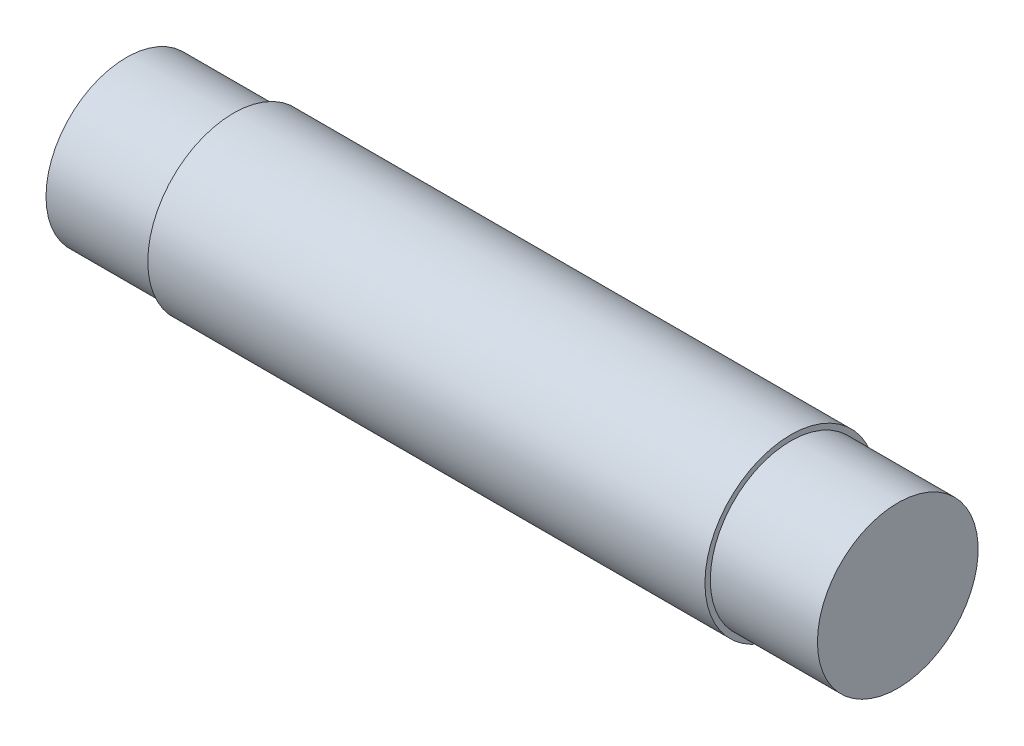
ISO-10303-21;
HEADER;
FILE_DESCRIPTION(('STEP AP214'),'2;1');
FILE_NAME('part.step','',(''),(''),'','','');
FILE_SCHEMA(('AUTOMOTIVE_DESIGN { 1 0 10303 214 1 1 1 1 }'));
ENDSEC;
DATA;
#1=APPLICATION_CONTEXT('core data for automotive mechanical design processes');
#2=APPLICATION_PROTOCOL_DEFINITION('international standard','automotive_design',2000,#1);
#3=PRODUCT_CONTEXT('',#1,'mechanical');
#4=PRODUCT('Part','Part','',(#3));
#5=PRODUCT_RELATED_PRODUCT_CATEGORY('part','',(#4));
#6=PRODUCT_DEFINITION_FORMATION('','',#4);
#7=PRODUCT_DEFINITION_CONTEXT('part definition',#1,'design');
#8=PRODUCT_DEFINITION('design','',#6,#7);
#9=PRODUCT_DEFINITION_SHAPE('','',#8);
#10=(LENGTH_UNIT() NAMED_UNIT(*) SI_UNIT(.MILLI.,.METRE.));
#11=(NAMED_UNIT(*) PLANE_ANGLE_UNIT() SI_UNIT($,.RADIAN.));
#12=(NAMED_UNIT(*) SI_UNIT($,.STERADIAN.) SOLID_ANGLE_UNIT());
#13=UNCERTAINTY_MEASURE_WITH_UNIT(LENGTH_MEASURE(1.E-05),#10,'distance_accuracy_value','');
#14=(GEOMETRIC_REPRESENTATION_CONTEXT(3) GLOBAL_UNCERTAINTY_ASSIGNED_CONTEXT((#13)) GLOBAL_UNIT_ASSIGNED_CONTEXT((#10,
#11,#12)) REPRESENTATION_CONTEXT('',''));
#15=CARTESIAN_POINT('',(0.,0.,0.));
#16=DIRECTION('',(0.,0.,1.));
#17=DIRECTION('',(1.,0.,0.));
#18=AXIS2_PLACEMENT_3D('',#15,#16,#17);
#19=CARTESIAN_POINT('',(72.,0.,0.));
#20=DIRECTION('',(1.,0.,0.));
#21=DIRECTION('',(0.,0.,-1.));
#22=AXIS2_PLACEMENT_3D('',#19,#20,#21);
#23=PLANE('',#22);
#24=CARTESIAN_POINT('',(72.,0.,0.));
#25=DIRECTION('',(-1.,0.,0.));
#26=DIRECTION('',(0.,0.,1.));
#27=AXIS2_PLACEMENT_3D('',#24,#25,#26);
#28=CIRCLE('',#27,7.5);
#29=CARTESIAN_POINT('',(72.,0.,7.5));
#30=VERTEX_POINT('',#29);
#31=EDGE_CURVE('E18',#30,#30,#28,.T.);
#32=ORIENTED_EDGE('',*,*,#31,.F.);
#33=EDGE_LOOP('',(#32));
#34=FACE_BOUND('',#33,.T.);
#35=ADVANCED_FACE('F15',(#34),#23,.T.);
#36=CARTESIAN_POINT('',(0.,0.,0.));
#37=DIRECTION('',(1.,0.,0.));
#38=DIRECTION('',(0.,0.,-1.));
#39=AXIS2_PLACEMENT_3D('',#36,#37,#38);
#40=PLANE('',#39);
#41=CARTESIAN_POINT('',(0.,0.,0.));
#42=DIRECTION('',(-1.,0.,0.));
#43=DIRECTION('',(0.,0.,1.));
#44=AXIS2_PLACEMENT_3D('',#41,#42,#43);
#45=CIRCLE('',#44,7.5);
#46=CARTESIAN_POINT('',(0.,0.,7.5));
#47=VERTEX_POINT('',#46);
#48=EDGE_CURVE('E34',#47,#47,#45,.F.);
#49=ORIENTED_EDGE('',*,*,#48,.F.);
#50=EDGE_LOOP('',(#49));
#51=FACE_BOUND('',#50,.T.);
#52=ADVANCED_FACE('F44',(#51),#40,.F.);
#53=CARTESIAN_POINT('',(72.,0.,0.));
#54=DIRECTION('',(-1.,0.,0.));
#55=DIRECTION('',(0.,0.,1.));
#56=AXIS2_PLACEMENT_3D('',#53,#54,#55);
#57=CYLINDRICAL_SURFACE('',#56,7.5);
#58=CARTESIAN_POINT('',(62.,0.,0.));
#59=DIRECTION('',(-1.,0.,0.));
#60=DIRECTION('',(0.,0.,1.));
#61=AXIS2_PLACEMENT_3D('',#58,#59,#60);
#62=CIRCLE('',#61,7.5);
#63=CARTESIAN_POINT('',(62.,0.,7.5));
#64=VERTEX_POINT('',#63);
#65=EDGE_CURVE('E32',#64,#64,#62,.T.);
#66=ORIENTED_EDGE('',*,*,#65,.F.);
#67=EDGE_LOOP('',(#66));
#68=FACE_BOUND('',#67,.T.);
#69=ORIENTED_EDGE('',*,*,#31,.T.);
#70=EDGE_LOOP('',(#69));
#71=FACE_BOUND('',#70,.T.);
#72=ADVANCED_FACE('F41',(#68,#71),#57,.T.);
#73=CARTESIAN_POINT('',(10.,0.,0.));
#74=DIRECTION('',(-1.,0.,0.));
#75=DIRECTION('',(0.,0.,1.));
#76=AXIS2_PLACEMENT_3D('',#73,#74,#75);
#77=CYLINDRICAL_SURFACE('',#76,7.5);
#78=CARTESIAN_POINT('',(10.,0.,0.));
#79=DIRECTION('',(-1.,0.,0.));
#80=DIRECTION('',(0.,0.,1.));
#81=AXIS2_PLACEMENT_3D('',#78,#79,#80);
#82=CIRCLE('',#81,7.5);
#83=CARTESIAN_POINT('',(10.,0.,7.5));
#84=VERTEX_POINT('',#83);
#85=EDGE_CURVE('E27',#84,#84,#82,.T.);
#86=ORIENTED_EDGE('',*,*,#85,.T.);
#87=EDGE_LOOP('',(#86));
#88=FACE_BOUND('',#87,.T.);
#89=ORIENTED_EDGE('',*,*,#48,.T.);
#90=EDGE_LOOP('',(#89));
#91=FACE_BOUND('',#90,.T.);
#92=ADVANCED_FACE('F64',(#88,#91),#77,.T.);
#93=CARTESIAN_POINT('',(62.,0.,0.));
#94=DIRECTION('',(1.,0.,0.));
#95=DIRECTION('',(0.,0.,-1.));
#96=AXIS2_PLACEMENT_3D('',#93,#94,#95);
#97=PLANE('',#96);
#98=ORIENTED_EDGE('',*,*,#65,.T.);
#99=EDGE_LOOP('',(#98));
#100=FACE_BOUND('',#99,.T.);
#101=CARTESIAN_POINT('',(62.,0.,0.));
#102=DIRECTION('',(-1.,0.,0.));
#103=DIRECTION('',(0.,0.,1.));
#104=AXIS2_PLACEMENT_3D('',#101,#102,#103);
#105=CIRCLE('',#104,8.);
#106=CARTESIAN_POINT('',(62.,0.,8.));
#107=VERTEX_POINT('',#106);
#108=EDGE_CURVE('E22',#107,#107,#105,.T.);
#109=ORIENTED_EDGE('',*,*,#108,.F.);
#110=EDGE_LOOP('',(#109));
#111=FACE_BOUND('',#110,.T.);
#112=ADVANCED_FACE('F57',(#100,#111),#97,.T.);
#113=CARTESIAN_POINT('',(10.,0.,0.));
#114=DIRECTION('',(1.,0.,0.));
#115=DIRECTION('',(0.,0.,-1.));
#116=AXIS2_PLACEMENT_3D('',#113,#114,#115);
#117=PLANE('',#116);
#118=ORIENTED_EDGE('',*,*,#85,.F.);
#119=EDGE_LOOP('',(#118));
#120=FACE_BOUND('',#119,.T.);
#121=CARTESIAN_POINT('',(10.,0.,0.));
#122=DIRECTION('',(-1.,0.,0.));
#123=DIRECTION('',(0.,0.,1.));
#124=AXIS2_PLACEMENT_3D('',#121,#122,#123);
#125=CIRCLE('',#124,8.);
#126=CARTESIAN_POINT('',(10.,0.,8.));
#127=VERTEX_POINT('',#126);
#128=EDGE_CURVE('E10',#127,#127,#125,.F.);
#129=ORIENTED_EDGE('',*,*,#128,.F.);
#130=EDGE_LOOP('',(#129));
#131=FACE_BOUND('',#130,.T.);
#132=ADVANCED_FACE('F52',(#120,#131),#117,.F.);
#133=CARTESIAN_POINT('',(62.,0.,0.));
#134=DIRECTION('',(-1.,0.,0.));
#135=DIRECTION('',(0.,0.,1.));
#136=AXIS2_PLACEMENT_3D('',#133,#134,#135);
#137=CYLINDRICAL_SURFACE('',#136,8.);
#138=ORIENTED_EDGE('',*,*,#128,.T.);
#139=EDGE_LOOP('',(#138));
#140=FACE_BOUND('',#139,.T.);
#141=ORIENTED_EDGE('',*,*,#108,.T.);
#142=EDGE_LOOP('',(#141));
#143=FACE_BOUND('',#142,.T.);
#144=ADVANCED_FACE('F50',(#140,#143),#137,.T.);
#145=CLOSED_SHELL('',(#35,#52,#72,#92,#112,#132,#144));
#146=MANIFOLD_SOLID_BREP('B1',#145);
#147=ADVANCED_BREP_SHAPE_REPRESENTATION('',(#18,#146),#14);
#148=SHAPE_DEFINITION_REPRESENTATION(#9,#147);
ENDSEC;
END-ISO-10303-21;
